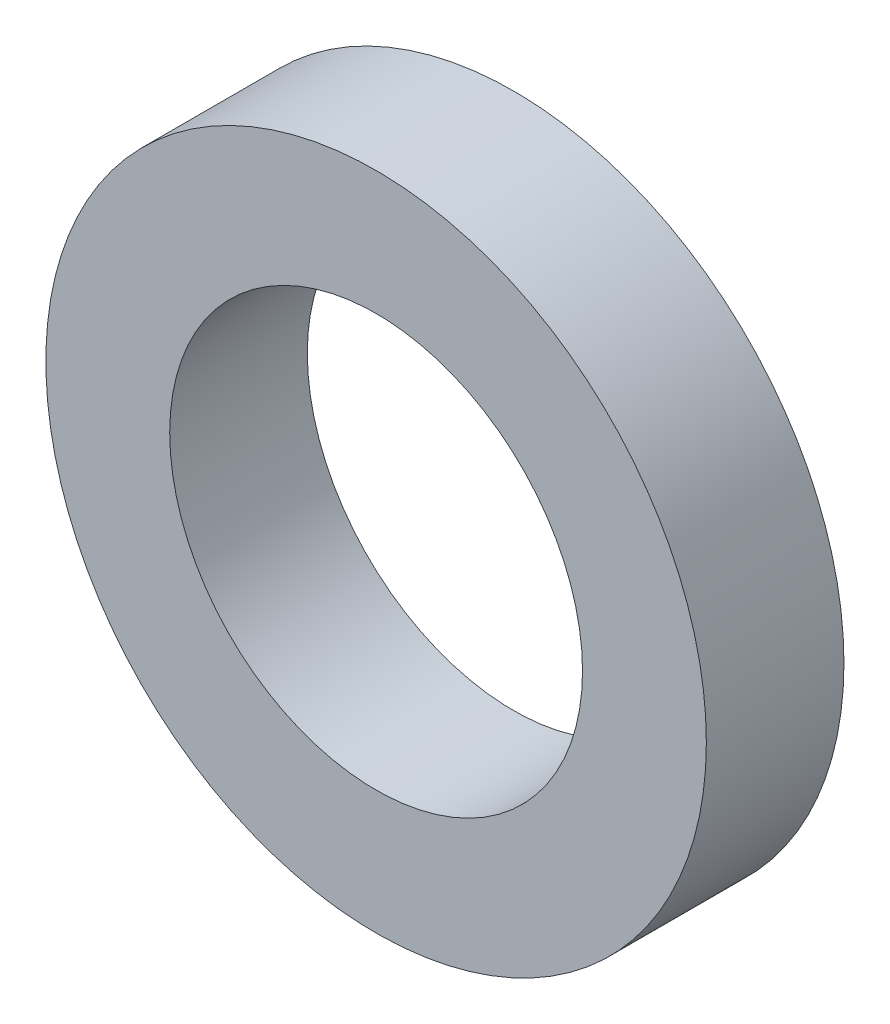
from build123d import *

# Parameters (mm, degrees)
SKETCH1_R           = 12
SKETCH1_R_2         = 7.5
BOSS_EXTRUDE1_DEPTH = 5


with BuildPart() as part:
    # Sketch1 → Boss-Extrude1 (new body)
    with BuildSketch(Plane.XY):
        Circle(SKETCH1_R)
        Circle(SKETCH1_R_2, mode=Mode.SUBTRACT)
    extrude(amount=BOSS_EXTRUDE1_DEPTH)


solid = part.part
